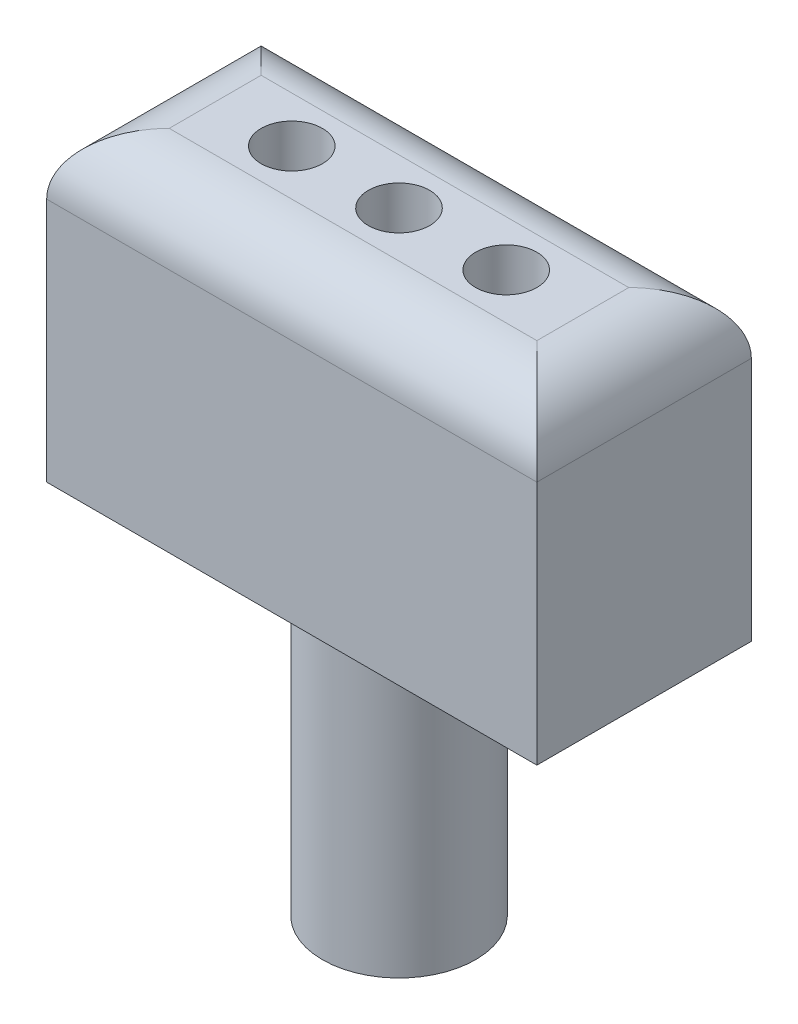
from build123d import *

# Parameters (mm, degrees)
SKETCH1_R           = 12.5
BOSS_EXTRUDE1_DEPTH = 50
SKETCH2_W           = 80
SKETCH2_H           = 35
BOSS_EXTRUDE2_DEPTH = 50
FILLET1_R           = 10
SKETCH3_R           = 5
CUT_EXTRUDE1_DEPTH  = 10


with BuildPart() as part:
    # Sketch1 → Boss-Extrude1 (new body)
    with BuildSketch(Plane(origin=(0, 0, 0), x_dir=(1, 0, 0), z_dir=(0, 1, 0))):
        with Locations(Location((0, 0, 0), (0, 0, 270))):
            Circle(SKETCH1_R)
    extrude(amount=BOSS_EXTRUDE1_DEPTH)

    # Sketch2 → Boss-Extrude2 (add)
    with BuildSketch(Plane(origin=(0, 50, 0), x_dir=(1, 0, 0), z_dir=(0, 1, 0))):
        Rectangle(SKETCH2_W, SKETCH2_H)
    extrude(amount=BOSS_EXTRUDE2_DEPTH)

    # Fillet1
    fillet1_edges = [part.edges().sort_by_distance(p)[0] for p in [
        (40, 100, 0),
        (0, 100, -17.5),
        (-40, 100, 0),
        (0, 100, 17.5),
    ]]
    fillet(fillet1_edges, radius=FILLET1_R)

    # Sketch3 → Cut-Extrude1 (cut)
    with BuildSketch(Plane(origin=(0, 100, 0), x_dir=(1, 0, 0), z_dir=(0, 1, 0))):
        with Locations(Location((0, 0, 0), (0, 0, 270))):
            Circle(SKETCH3_R)
        with Locations(Location((-17.5, 0, 0), (0, 0, 270))):
            Circle(SKETCH3_R)
        with Locations(Location((17.5, 0, 0), (0, 0, 90))):
            Circle(SKETCH3_R)
    extrude(amount=-CUT_EXTRUDE1_DEPTH, mode=Mode.SUBTRACT)


solid = part.part
